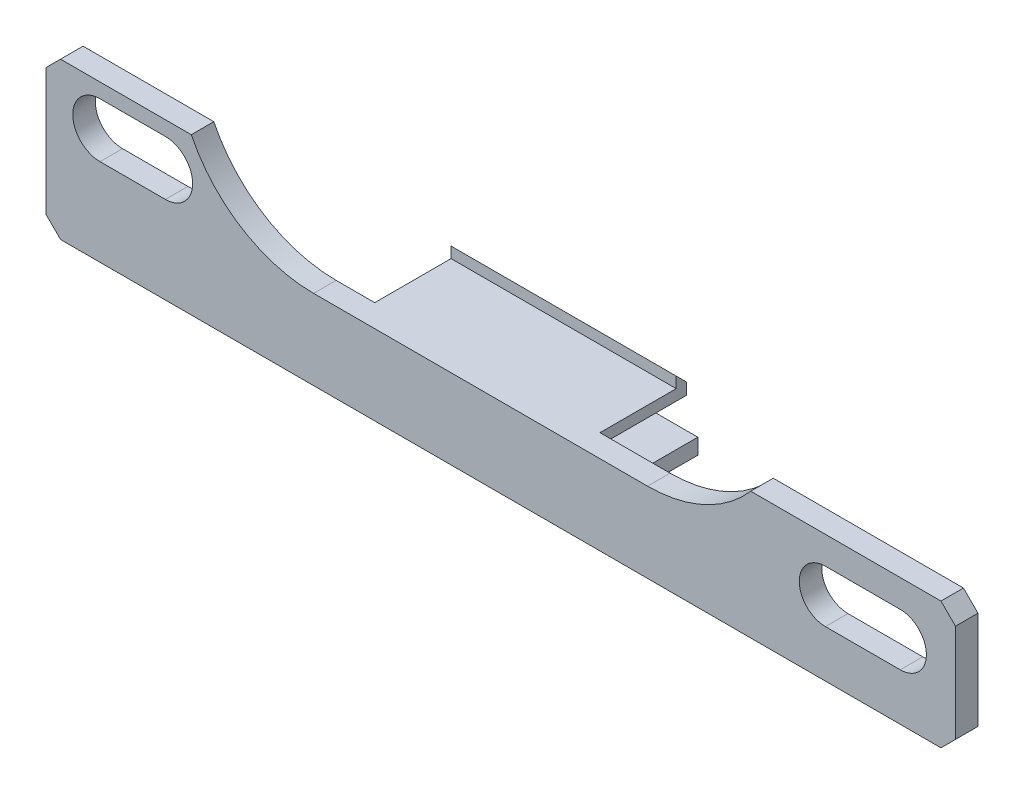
ISO-10303-21;
HEADER;
FILE_DESCRIPTION(('STEP AP214'),'2;1');
FILE_NAME('part.step','',(''),(''),'','','');
FILE_SCHEMA(('AUTOMOTIVE_DESIGN { 1 0 10303 214 1 1 1 1 }'));
ENDSEC;
DATA;
#1=APPLICATION_CONTEXT('core data for automotive mechanical design processes');
#2=APPLICATION_PROTOCOL_DEFINITION('international standard','automotive_design',2000,#1);
#3=PRODUCT_CONTEXT('',#1,'mechanical');
#4=PRODUCT('Part','Part','',(#3));
#5=PRODUCT_RELATED_PRODUCT_CATEGORY('part','',(#4));
#6=PRODUCT_DEFINITION_FORMATION('','',#4);
#7=PRODUCT_DEFINITION_CONTEXT('part definition',#1,'design');
#8=PRODUCT_DEFINITION('design','',#6,#7);
#9=PRODUCT_DEFINITION_SHAPE('','',#8);
#10=(LENGTH_UNIT() NAMED_UNIT(*) SI_UNIT(.MILLI.,.METRE.));
#11=(NAMED_UNIT(*) PLANE_ANGLE_UNIT() SI_UNIT($,.RADIAN.));
#12=(NAMED_UNIT(*) SI_UNIT($,.STERADIAN.) SOLID_ANGLE_UNIT());
#13=UNCERTAINTY_MEASURE_WITH_UNIT(LENGTH_MEASURE(1.E-05),#10,'distance_accuracy_value','');
#14=(GEOMETRIC_REPRESENTATION_CONTEXT(3) GLOBAL_UNCERTAINTY_ASSIGNED_CONTEXT((#13)) GLOBAL_UNIT_ASSIGNED_CONTEXT((#10,
#11,#12)) REPRESENTATION_CONTEXT('',''));
#15=CARTESIAN_POINT('',(0.,0.,0.));
#16=DIRECTION('',(0.,0.,1.));
#17=DIRECTION('',(1.,0.,0.));
#18=AXIS2_PLACEMENT_3D('',#15,#16,#17);
#19=CARTESIAN_POINT('',(42.0649046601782,15.113,-1.5748));
#20=DIRECTION('',(0.,0.,-1.));
#21=DIRECTION('',(-1.,0.,0.));
#22=AXIS2_PLACEMENT_3D('',#19,#20,#21);
#23=PLANE('',#22);
#24=DIRECTION('',(0.,1.,0.));
#25=VECTOR('',#24,1.);
#26=CARTESIAN_POINT('',(20.687107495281,15.113,-1.5748));
#27=LINE('',#26,#25);
#28=CARTESIAN_POINT('',(20.687107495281,1.6002,-1.5748));
#29=VERTEX_POINT('',#28);
#30=CARTESIAN_POINT('',(20.687107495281,2.6924,-1.5748));
#31=VERTEX_POINT('',#30);
#32=EDGE_CURVE('E327',#29,#31,#27,.T.);
#33=ORIENTED_EDGE('',*,*,#32,.F.);
#34=DIRECTION('',(-1.,0.,0.));
#35=VECTOR('',#34,1.);
#36=CARTESIAN_POINT('',(42.0649046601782,1.6002,-1.5748));
#37=LINE('',#36,#35);
#38=CARTESIAN_POINT('',(37.959107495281,1.6002,-1.5748));
#39=VERTEX_POINT('',#38);
#40=EDGE_CURVE('E310',#39,#29,#37,.T.);
#41=ORIENTED_EDGE('',*,*,#40,.F.);
#42=DIRECTION('',(0.,-1.,0.));
#43=VECTOR('',#42,1.);
#44=CARTESIAN_POINT('',(37.959107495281,15.113,-1.5748));
#45=LINE('',#44,#43);
#46=CARTESIAN_POINT('',(37.959107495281,2.6924,-1.5748));
#47=VERTEX_POINT('',#46);
#48=EDGE_CURVE('E321',#47,#39,#45,.T.);
#49=ORIENTED_EDGE('',*,*,#48,.F.);
#50=DIRECTION('',(1.,0.,0.));
#51=VECTOR('',#50,1.);
#52=CARTESIAN_POINT('',(42.0649046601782,2.6924,-1.5748));
#53=LINE('',#52,#51);
#54=EDGE_CURVE('E324',#31,#47,#53,.T.);
#55=ORIENTED_EDGE('',*,*,#54,.F.);
#56=EDGE_LOOP('',(#33,#41,#49,#55));
#57=FACE_BOUND('',#56,.T.);
#58=CARTESIAN_POINT('',(54.4998284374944,5.1308,-1.5748));
#59=DIRECTION('',(0.,0.,1.));
#60=DIRECTION('',(1.,0.,0.));
#61=AXIS2_PLACEMENT_3D('',#58,#59,#60);
#62=CIRCLE('',#61,1.8288);
#63=CARTESIAN_POINT('',(54.4998284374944,6.9596,-1.5748));
#64=VERTEX_POINT('',#63);
#65=CARTESIAN_POINT('',(54.4998284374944,3.302,-1.5748));
#66=VERTEX_POINT('',#65);
#67=EDGE_CURVE('E331',#64,#66,#62,.T.);
#68=ORIENTED_EDGE('',*,*,#67,.T.);
#69=DIRECTION('',(1.,0.,0.));
#70=VECTOR('',#69,1.);
#71=CARTESIAN_POINT('',(54.4998284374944,3.302,-1.5748));
#72=LINE('',#71,#70);
#73=CARTESIAN_POINT('',(59.7322284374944,3.302,-1.5748));
#74=VERTEX_POINT('',#73);
#75=EDGE_CURVE('E334',#66,#74,#72,.T.);
#76=ORIENTED_EDGE('',*,*,#75,.T.);
#77=CARTESIAN_POINT('',(59.7322284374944,5.1308,-1.5748));
#78=DIRECTION('',(0.,0.,1.));
#79=DIRECTION('',(1.,0.,0.));
#80=AXIS2_PLACEMENT_3D('',#77,#78,#79);
#81=CIRCLE('',#80,1.8288);
#82=CARTESIAN_POINT('',(59.7322284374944,6.9596,-1.5748));
#83=VERTEX_POINT('',#82);
#84=EDGE_CURVE('E338',#74,#83,#81,.T.);
#85=ORIENTED_EDGE('',*,*,#84,.T.);
#86=DIRECTION('',(-1.,0.,0.));
#87=VECTOR('',#86,1.);
#88=CARTESIAN_POINT('',(54.4998284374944,6.9596,-1.5748));
#89=LINE('',#88,#87);
#90=EDGE_CURVE('E341',#83,#64,#89,.T.);
#91=ORIENTED_EDGE('',*,*,#90,.T.);
#92=EDGE_LOOP('',(#68,#76,#85,#91));
#93=FACE_BOUND('',#92,.T.);
#94=CARTESIAN_POINT('',(3.7760284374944,8.001,-1.5748));
#95=DIRECTION('',(0.,0.,1.));
#96=DIRECTION('',(1.,0.,0.));
#97=AXIS2_PLACEMENT_3D('',#94,#95,#96);
#98=CIRCLE('',#97,1.905);
#99=CARTESIAN_POINT('',(3.7760284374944,9.906,-1.5748));
#100=VERTEX_POINT('',#99);
#101=CARTESIAN_POINT('',(3.7760284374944,6.096,-1.5748));
#102=VERTEX_POINT('',#101);
#103=EDGE_CURVE('E363',#100,#102,#98,.T.);
#104=ORIENTED_EDGE('',*,*,#103,.T.);
#105=DIRECTION('',(1.,0.,0.));
#106=VECTOR('',#105,1.);
#107=CARTESIAN_POINT('',(3.7760284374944,6.096,-1.5748));
#108=LINE('',#107,#106);
#109=CARTESIAN_POINT('',(8.3480284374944,6.096,-1.5748));
#110=VERTEX_POINT('',#109);
#111=EDGE_CURVE('E366',#102,#110,#108,.T.);
#112=ORIENTED_EDGE('',*,*,#111,.T.);
#113=CARTESIAN_POINT('',(8.3480284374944,8.001,-1.5748));
#114=DIRECTION('',(0.,0.,1.));
#115=DIRECTION('',(1.,0.,0.));
#116=AXIS2_PLACEMENT_3D('',#113,#114,#115);
#117=CIRCLE('',#116,1.905);
#118=CARTESIAN_POINT('',(8.3480284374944,9.906,-1.5748));
#119=VERTEX_POINT('',#118);
#120=EDGE_CURVE('E370',#110,#119,#117,.T.);
#121=ORIENTED_EDGE('',*,*,#120,.T.);
#122=DIRECTION('',(-1.,0.,0.));
#123=VECTOR('',#122,1.);
#124=CARTESIAN_POINT('',(3.7760284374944,9.906,-1.5748));
#125=LINE('',#124,#123);
#126=EDGE_CURVE('E373',#119,#100,#125,.T.);
#127=ORIENTED_EDGE('',*,*,#126,.T.);
#128=EDGE_LOOP('',(#104,#112,#121,#127));
#129=FACE_BOUND('',#128,.T.);
#130=DIRECTION('',(0.,1.,0.));
#131=VECTOR('',#130,1.);
#132=CARTESIAN_POINT('',(63.595327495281,0.,-1.5748));
#133=LINE('',#132,#131);
#134=CARTESIAN_POINT('',(63.595327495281,1.016,-1.5748));
#135=VERTEX_POINT('',#134);
#136=CARTESIAN_POINT('',(63.595327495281,7.87399999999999,-1.5748));
#137=VERTEX_POINT('',#136);
#138=EDGE_CURVE('E398',#135,#137,#133,.T.);
#139=ORIENTED_EDGE('',*,*,#138,.F.);
#140=DIRECTION('',(0.707106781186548,0.707106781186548,0.));
#141=VECTOR('',#140,1.);
#142=CARTESIAN_POINT('',(59.8786160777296,-2.70071141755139,-1.5748));
#143=LINE('',#142,#141);
#144=CARTESIAN_POINT('',(62.579327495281,0.,-1.5748));
#145=VERTEX_POINT('',#144);
#146=EDGE_CURVE('E468',#135,#145,#143,.F.);
#147=ORIENTED_EDGE('',*,*,#146,.T.);
#148=DIRECTION('',(1.,0.,0.));
#149=VECTOR('',#148,1.);
#150=CARTESIAN_POINT('',(0.,0.,-1.5748));
#151=LINE('',#150,#149);
#152=CARTESIAN_POINT('',(1.01600000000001,0.,-1.5748));
#153=VERTEX_POINT('',#152);
#154=EDGE_CURVE('E395',#153,#145,#151,.T.);
#155=ORIENTED_EDGE('',*,*,#154,.F.);
#156=DIRECTION('',(0.707106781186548,-0.707106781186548,0.));
#157=VECTOR('',#156,1.);
#158=CARTESIAN_POINT('',(13.9839523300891,-12.9679523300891,-1.5748));
#159=LINE('',#158,#157);
#160=CARTESIAN_POINT('',(0.,1.01600000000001,-1.5748));
#161=VERTEX_POINT('',#160);
#162=EDGE_CURVE('E55',#153,#161,#159,.F.);
#163=ORIENTED_EDGE('',*,*,#162,.T.);
#164=DIRECTION('',(0.,-1.,0.));
#165=VECTOR('',#164,1.);
#166=CARTESIAN_POINT('',(0.,0.,-1.5748));
#167=LINE('',#166,#165);
#168=CARTESIAN_POINT('',(0.,9.90599999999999,-1.5748));
#169=VERTEX_POINT('',#168);
#170=EDGE_CURVE('E414',#169,#161,#167,.T.);
#171=ORIENTED_EDGE('',*,*,#170,.F.);
#172=DIRECTION('',(-0.707106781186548,-0.707106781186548,0.));
#173=VECTOR('',#172,1.);
#174=CARTESIAN_POINT('',(23.6359523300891,33.5419523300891,-1.5748));
#175=LINE('',#174,#173);
#176=CARTESIAN_POINT('',(1.01600000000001,10.922,-1.5748));
#177=VERTEX_POINT('',#176);
#178=EDGE_CURVE('E49',#169,#177,#175,.F.);
#179=ORIENTED_EDGE('',*,*,#178,.T.);
#180=DIRECTION('',(-1.,0.,0.));
#181=VECTOR('',#180,1.);
#182=CARTESIAN_POINT('',(0.,10.922,-1.5748));
#183=LINE('',#182,#181);
#184=CARTESIAN_POINT('',(10.16,10.922,-1.5748));
#185=VERTEX_POINT('',#184);
#186=EDGE_CURVE('E412',#185,#177,#183,.T.);
#187=ORIENTED_EDGE('',*,*,#186,.F.);
#188=CARTESIAN_POINT('',(18.7134287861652,15.113,-1.5748));
#189=DIRECTION('',(0.,0.,-1.));
#190=DIRECTION('',(1.,0.,0.));
#191=AXIS2_PLACEMENT_3D('',#188,#189,#190);
#192=CIRCLE('',#191,9.525);
#193=CARTESIAN_POINT('',(18.7134287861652,5.588,-1.5748));
#194=VERTEX_POINT('',#193);
#195=EDGE_CURVE('E409',#194,#185,#192,.T.);
#196=ORIENTED_EDGE('',*,*,#195,.F.);
#197=DIRECTION('',(-1.,0.,0.));
#198=VECTOR('',#197,1.);
#199=CARTESIAN_POINT('',(18.7134287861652,5.588,-1.5748));
#200=LINE('',#199,#198);
#201=CARTESIAN_POINT('',(21.4122,5.588,-1.5748));
#202=VERTEX_POINT('',#201);
#203=EDGE_CURVE('E407',#202,#194,#200,.T.);
#204=ORIENTED_EDGE('',*,*,#203,.F.);
#205=DIRECTION('',(0.,1.,0.));
#206=VECTOR('',#205,1.);
#207=CARTESIAN_POINT('',(21.4122,4.826,-1.5748));
#208=LINE('',#207,#206);
#209=CARTESIAN_POINT('',(21.4122,4.826,-1.5748));
#210=VERTEX_POINT('',#209);
#211=EDGE_CURVE('E272',#210,#202,#208,.T.);
#212=ORIENTED_EDGE('',*,*,#211,.F.);
#213=DIRECTION('',(-1.,0.,0.));
#214=VECTOR('',#213,1.);
#215=CARTESIAN_POINT('',(37.1602,4.826,-1.5748));
#216=LINE('',#215,#214);
#217=CARTESIAN_POINT('',(37.1602,4.826,-1.5748));
#218=VERTEX_POINT('',#217);
#219=EDGE_CURVE('E286',#218,#210,#216,.T.);
#220=ORIENTED_EDGE('',*,*,#219,.F.);
#221=DIRECTION('',(0.,1.,0.));
#222=VECTOR('',#221,1.);
#223=CARTESIAN_POINT('',(37.1602,4.826,-1.5748));
#224=LINE('',#223,#222);
#225=CARTESIAN_POINT('',(37.1602,5.588,-1.5748));
#226=VERTEX_POINT('',#225);
#227=EDGE_CURVE('E261',#218,#226,#224,.T.);
#228=ORIENTED_EDGE('',*,*,#227,.T.);
#229=CARTESIAN_POINT('',(42.0649046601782,5.588,-1.5748));
#230=VERTEX_POINT('',#229);
#231=EDGE_CURVE('E260',#230,#226,#200,.T.);
#232=ORIENTED_EDGE('',*,*,#231,.F.);
#233=CARTESIAN_POINT('',(42.0649046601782,15.113,-1.5748));
#234=DIRECTION('',(0.,0.,-1.));
#235=DIRECTION('',(-1.,0.,0.));
#236=AXIS2_PLACEMENT_3D('',#233,#234,#235);
#237=CIRCLE('',#236,9.525);
#238=CARTESIAN_POINT('',(49.276,8.89,-1.5748));
#239=VERTEX_POINT('',#238);
#240=EDGE_CURVE('E404',#239,#230,#237,.T.);
#241=ORIENTED_EDGE('',*,*,#240,.F.);
#242=DIRECTION('',(-1.,0.,0.));
#243=VECTOR('',#242,1.);
#244=CARTESIAN_POINT('',(63.595327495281,8.89,-1.5748));
#245=LINE('',#244,#243);
#246=CARTESIAN_POINT('',(62.5793274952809,8.89,-1.5748));
#247=VERTEX_POINT('',#246);
#248=EDGE_CURVE('E402',#247,#239,#245,.T.);
#249=ORIENTED_EDGE('',*,*,#248,.F.);
#250=DIRECTION('',(-0.70710678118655,0.707106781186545,0.));
#251=VECTOR('',#250,1.);
#252=CARTESIAN_POINT('',(49.2106160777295,22.2587114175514,-1.5748));
#253=LINE('',#252,#251);
#254=EDGE_CURVE('E466',#247,#137,#253,.F.);
#255=ORIENTED_EDGE('',*,*,#254,.T.);
#256=EDGE_LOOP('',(#139,#147,#155,#163,#171,#179,#187,#196,#204,#212,#220,#228,#232,#241,#249,#255));
#257=FACE_BOUND('',#256,.T.);
#258=ADVANCED_FACE('F34',(#57,#93,#129,#257),#23,.T.);
#259=CARTESIAN_POINT('',(0.,0.,-1.5748));
#260=DIRECTION('',(0.,-1.,0.));
#261=DIRECTION('',(0.,0.,-1.));
#262=AXIS2_PLACEMENT_3D('',#259,#260,#261);
#263=PLANE('',#262);
#264=ORIENTED_EDGE('',*,*,#154,.T.);
#265=DIRECTION('',(0.,0.,1.));
#266=VECTOR('',#265,1.);
#267=CARTESIAN_POINT('',(62.579327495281,0.,-1.5748));
#268=LINE('',#267,#266);
#269=CARTESIAN_POINT('',(62.579327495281,0.,0.));
#270=VERTEX_POINT('',#269);
#271=EDGE_CURVE('E448',#145,#270,#268,.T.);
#272=ORIENTED_EDGE('',*,*,#271,.T.);
#273=DIRECTION('',(1.,0.,0.));
#274=VECTOR('',#273,1.);
#275=CARTESIAN_POINT('',(0.,0.,0.));
#276=LINE('',#275,#274);
#277=CARTESIAN_POINT('',(1.01600000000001,0.,0.));
#278=VERTEX_POINT('',#277);
#279=EDGE_CURVE('E388',#278,#270,#276,.T.);
#280=ORIENTED_EDGE('',*,*,#279,.F.);
#281=DIRECTION('',(0.,0.,-1.));
#282=VECTOR('',#281,1.);
#283=CARTESIAN_POINT('',(1.01600000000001,0.,-1.5748));
#284=LINE('',#283,#282);
#285=EDGE_CURVE('E440',#278,#153,#284,.T.);
#286=ORIENTED_EDGE('',*,*,#285,.T.);
#287=EDGE_LOOP('',(#264,#272,#280,#286));
#288=FACE_BOUND('',#287,.T.);
#289=ADVANCED_FACE('F527',(#288),#263,.T.);
#290=CARTESIAN_POINT('',(0.,0.,-1.5748));
#291=DIRECTION('',(-1.,0.,0.));
#292=DIRECTION('',(0.,0.,1.));
#293=AXIS2_PLACEMENT_3D('',#290,#291,#292);
#294=PLANE('',#293);
#295=ORIENTED_EDGE('',*,*,#170,.T.);
#296=DIRECTION('',(0.,0.,1.));
#297=VECTOR('',#296,1.);
#298=CARTESIAN_POINT('',(0.,1.01600000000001,-1.5748));
#299=LINE('',#298,#297);
#300=CARTESIAN_POINT('',(0.,1.01600000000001,0.));
#301=VERTEX_POINT('',#300);
#302=EDGE_CURVE('E42',#161,#301,#299,.T.);
#303=ORIENTED_EDGE('',*,*,#302,.T.);
#304=DIRECTION('',(0.,-1.,0.));
#305=VECTOR('',#304,1.);
#306=CARTESIAN_POINT('',(0.,0.,0.));
#307=LINE('',#306,#305);
#308=CARTESIAN_POINT('',(0.,9.90599999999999,0.));
#309=VERTEX_POINT('',#308);
#310=EDGE_CURVE('E399',#309,#301,#307,.T.);
#311=ORIENTED_EDGE('',*,*,#310,.F.);
#312=DIRECTION('',(0.,0.,-1.));
#313=VECTOR('',#312,1.);
#314=CARTESIAN_POINT('',(0.,9.90599999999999,-1.5748));
#315=LINE('',#314,#313);
#316=EDGE_CURVE('E472',#309,#169,#315,.T.);
#317=ORIENTED_EDGE('',*,*,#316,.T.);
#318=EDGE_LOOP('',(#295,#303,#311,#317));
#319=FACE_BOUND('',#318,.T.);
#320=ADVANCED_FACE('F477',(#319),#294,.T.);
#321=CARTESIAN_POINT('',(0.,10.922,-1.5748));
#322=DIRECTION('',(0.,1.,0.));
#323=DIRECTION('',(0.,0.,1.));
#324=AXIS2_PLACEMENT_3D('',#321,#322,#323);
#325=PLANE('',#324);
#326=ORIENTED_EDGE('',*,*,#186,.T.);
#327=DIRECTION('',(0.,0.,1.));
#328=VECTOR('',#327,1.);
#329=CARTESIAN_POINT('',(1.01600000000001,10.922,-1.5748));
#330=LINE('',#329,#328);
#331=CARTESIAN_POINT('',(1.01600000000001,10.922,0.));
#332=VERTEX_POINT('',#331);
#333=EDGE_CURVE('E11',#177,#332,#330,.T.);
#334=ORIENTED_EDGE('',*,*,#333,.T.);
#335=DIRECTION('',(-1.,0.,0.));
#336=VECTOR('',#335,1.);
#337=CARTESIAN_POINT('',(0.,10.922,0.));
#338=LINE('',#337,#336);
#339=CARTESIAN_POINT('',(10.16,10.922,0.));
#340=VERTEX_POINT('',#339);
#341=EDGE_CURVE('E433',#340,#332,#338,.T.);
#342=ORIENTED_EDGE('',*,*,#341,.F.);
#343=DIRECTION('',(0.,0.,1.));
#344=VECTOR('',#343,1.);
#345=CARTESIAN_POINT('',(10.16,10.922,-1.5748));
#346=LINE('',#345,#344);
#347=EDGE_CURVE('E438',#185,#340,#346,.T.);
#348=ORIENTED_EDGE('',*,*,#347,.F.);
#349=EDGE_LOOP('',(#326,#334,#342,#348));
#350=FACE_BOUND('',#349,.T.);
#351=ADVANCED_FACE('F487',(#350),#325,.T.);
#352=CARTESIAN_POINT('',(18.7134287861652,15.113,-1.5748));
#353=DIRECTION('',(0.,0.,1.));
#354=DIRECTION('',(1.,0.,0.));
#355=AXIS2_PLACEMENT_3D('',#352,#353,#354);
#356=CYLINDRICAL_SURFACE('',#355,9.525);
#357=CARTESIAN_POINT('',(18.7134287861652,15.113,0.));
#358=DIRECTION('',(0.,0.,-1.));
#359=DIRECTION('',(1.,0.,0.));
#360=AXIS2_PLACEMENT_3D('',#357,#358,#359);
#361=CIRCLE('',#360,9.525);
#362=CARTESIAN_POINT('',(18.7134287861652,5.588,0.));
#363=VERTEX_POINT('',#362);
#364=EDGE_CURVE('E430',#363,#340,#361,.T.);
#365=ORIENTED_EDGE('',*,*,#364,.F.);
#366=DIRECTION('',(0.,0.,1.));
#367=VECTOR('',#366,1.);
#368=CARTESIAN_POINT('',(18.7134287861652,5.588,-1.5748));
#369=LINE('',#368,#367);
#370=EDGE_CURVE('E441',#194,#363,#369,.T.);
#371=ORIENTED_EDGE('',*,*,#370,.F.);
#372=ORIENTED_EDGE('',*,*,#195,.T.);
#373=ORIENTED_EDGE('',*,*,#347,.T.);
#374=EDGE_LOOP('',(#365,#371,#372,#373));
#375=FACE_BOUND('',#374,.T.);
#376=ADVANCED_FACE('F493',(#375),#356,.F.);
#377=CARTESIAN_POINT('',(18.7134287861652,5.588,-1.5748));
#378=DIRECTION('',(0.,1.,0.));
#379=DIRECTION('',(0.,0.,1.));
#380=AXIS2_PLACEMENT_3D('',#377,#378,#379);
#381=PLANE('',#380);
#382=DIRECTION('',(-1.,0.,0.));
#383=VECTOR('',#382,1.);
#384=CARTESIAN_POINT('',(18.7134287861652,5.588,0.));
#385=LINE('',#384,#383);
#386=CARTESIAN_POINT('',(42.0649046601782,5.588,0.));
#387=VERTEX_POINT('',#386);
#388=EDGE_CURVE('E427',#387,#363,#385,.T.);
#389=ORIENTED_EDGE('',*,*,#388,.F.);
#390=DIRECTION('',(0.,0.,1.));
#391=VECTOR('',#390,1.);
#392=CARTESIAN_POINT('',(42.0649046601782,5.588,-1.5748));
#393=LINE('',#392,#391);
#394=EDGE_CURVE('E443',#230,#387,#393,.T.);
#395=ORIENTED_EDGE('',*,*,#394,.F.);
#396=ORIENTED_EDGE('',*,*,#231,.T.);
#397=DIRECTION('',(0.,0.,-1.));
#398=VECTOR('',#397,1.);
#399=CARTESIAN_POINT('',(37.1602,5.588,-1.5748));
#400=LINE('',#399,#398);
#401=CARTESIAN_POINT('',(37.1602,5.588,-6.9088));
#402=VERTEX_POINT('',#401);
#403=EDGE_CURVE('E251',#226,#402,#400,.T.);
#404=ORIENTED_EDGE('',*,*,#403,.T.);
#405=DIRECTION('',(-1.,0.,0.));
#406=VECTOR('',#405,1.);
#407=CARTESIAN_POINT('',(37.1602,5.588,-6.9088));
#408=LINE('',#407,#406);
#409=CARTESIAN_POINT('',(21.4122,5.588,-6.9088));
#410=VERTEX_POINT('',#409);
#411=EDGE_CURVE('E233',#402,#410,#408,.T.);
#412=ORIENTED_EDGE('',*,*,#411,.T.);
#413=DIRECTION('',(0.,0.,-1.));
#414=VECTOR('',#413,1.);
#415=CARTESIAN_POINT('',(21.4122,5.588,-1.5748));
#416=LINE('',#415,#414);
#417=EDGE_CURVE('E275',#202,#410,#416,.T.);
#418=ORIENTED_EDGE('',*,*,#417,.F.);
#419=ORIENTED_EDGE('',*,*,#203,.T.);
#420=ORIENTED_EDGE('',*,*,#370,.T.);
#421=EDGE_LOOP('',(#389,#395,#396,#404,#412,#418,#419,#420));
#422=FACE_BOUND('',#421,.T.);
#423=ADVANCED_FACE('F258',(#422),#381,.T.);
#424=CARTESIAN_POINT('',(42.0649046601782,15.113,-1.5748));
#425=DIRECTION('',(0.,0.,1.));
#426=DIRECTION('',(1.,0.,0.));
#427=AXIS2_PLACEMENT_3D('',#424,#425,#426);
#428=CYLINDRICAL_SURFACE('',#427,9.525);
#429=CARTESIAN_POINT('',(42.0649046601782,15.113,0.));
#430=DIRECTION('',(0.,0.,-1.));
#431=DIRECTION('',(-1.,0.,0.));
#432=AXIS2_PLACEMENT_3D('',#429,#430,#431);
#433=CIRCLE('',#432,9.525);
#434=CARTESIAN_POINT('',(49.276,8.89,0.));
#435=VERTEX_POINT('',#434);
#436=EDGE_CURVE('E424',#435,#387,#433,.T.);
#437=ORIENTED_EDGE('',*,*,#436,.F.);
#438=DIRECTION('',(0.,0.,1.));
#439=VECTOR('',#438,1.);
#440=CARTESIAN_POINT('',(49.276,8.89,-1.5748));
#441=LINE('',#440,#439);
#442=EDGE_CURVE('E416',#239,#435,#441,.T.);
#443=ORIENTED_EDGE('',*,*,#442,.F.);
#444=ORIENTED_EDGE('',*,*,#240,.T.);
#445=ORIENTED_EDGE('',*,*,#394,.T.);
#446=EDGE_LOOP('',(#437,#443,#444,#445));
#447=FACE_BOUND('',#446,.T.);
#448=ADVANCED_FACE('F509',(#447),#428,.F.);
#449=CARTESIAN_POINT('',(63.595327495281,8.89,-1.5748));
#450=DIRECTION('',(0.,1.,0.));
#451=DIRECTION('',(-1.,0.,0.));
#452=AXIS2_PLACEMENT_3D('',#449,#450,#451);
#453=PLANE('',#452);
#454=DIRECTION('',(-1.,0.,0.));
#455=VECTOR('',#454,1.);
#456=CARTESIAN_POINT('',(63.595327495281,8.89,0.));
#457=LINE('',#456,#455);
#458=CARTESIAN_POINT('',(62.5793274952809,8.89,0.));
#459=VERTEX_POINT('',#458);
#460=EDGE_CURVE('E422',#459,#435,#457,.T.);
#461=ORIENTED_EDGE('',*,*,#460,.F.);
#462=DIRECTION('',(0.,0.,-1.));
#463=VECTOR('',#462,1.);
#464=CARTESIAN_POINT('',(62.5793274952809,8.89,-1.5748));
#465=LINE('',#464,#463);
#466=EDGE_CURVE('E470',#459,#247,#465,.T.);
#467=ORIENTED_EDGE('',*,*,#466,.T.);
#468=ORIENTED_EDGE('',*,*,#248,.T.);
#469=ORIENTED_EDGE('',*,*,#442,.T.);
#470=EDGE_LOOP('',(#461,#467,#468,#469));
#471=FACE_BOUND('',#470,.T.);
#472=ADVANCED_FACE('F512',(#471),#453,.T.);
#473=CARTESIAN_POINT('',(63.595327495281,0.,-1.5748));
#474=DIRECTION('',(1.,0.,0.));
#475=DIRECTION('',(0.,0.,-1.));
#476=AXIS2_PLACEMENT_3D('',#473,#474,#475);
#477=PLANE('',#476);
#478=DIRECTION('',(0.,1.,0.));
#479=VECTOR('',#478,1.);
#480=CARTESIAN_POINT('',(63.595327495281,0.,0.));
#481=LINE('',#480,#479);
#482=CARTESIAN_POINT('',(63.595327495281,1.016,0.));
#483=VERTEX_POINT('',#482);
#484=CARTESIAN_POINT('',(63.595327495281,7.87399999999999,0.));
#485=VERTEX_POINT('',#484);
#486=EDGE_CURVE('E419',#483,#485,#481,.T.);
#487=ORIENTED_EDGE('',*,*,#486,.F.);
#488=DIRECTION('',(0.,0.,-1.));
#489=VECTOR('',#488,1.);
#490=CARTESIAN_POINT('',(63.595327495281,1.016,-1.5748));
#491=LINE('',#490,#489);
#492=EDGE_CURVE('E462',#483,#135,#491,.T.);
#493=ORIENTED_EDGE('',*,*,#492,.T.);
#494=ORIENTED_EDGE('',*,*,#138,.T.);
#495=DIRECTION('',(0.,0.,1.));
#496=VECTOR('',#495,1.);
#497=CARTESIAN_POINT('',(63.595327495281,7.87399999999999,-1.5748));
#498=LINE('',#497,#496);
#499=EDGE_CURVE('E459',#137,#485,#498,.T.);
#500=ORIENTED_EDGE('',*,*,#499,.T.);
#501=EDGE_LOOP('',(#487,#493,#494,#500));
#502=FACE_BOUND('',#501,.T.);
#503=ADVANCED_FACE('F520',(#502),#477,.T.);
#504=CARTESIAN_POINT('',(42.0649046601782,15.113,0.));
#505=DIRECTION('',(0.,0.,-1.));
#506=DIRECTION('',(-1.,0.,0.));
#507=AXIS2_PLACEMENT_3D('',#504,#505,#506);
#508=PLANE('',#507);
#509=DIRECTION('',(1.,0.,0.));
#510=VECTOR('',#509,1.);
#511=CARTESIAN_POINT('',(54.4998284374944,3.302,0.));
#512=LINE('',#511,#510);
#513=CARTESIAN_POINT('',(54.4998284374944,3.302,0.));
#514=VERTEX_POINT('',#513);
#515=CARTESIAN_POINT('',(59.7322284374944,3.302,0.));
#516=VERTEX_POINT('',#515);
#517=EDGE_CURVE('E346',#514,#516,#512,.T.);
#518=ORIENTED_EDGE('',*,*,#517,.F.);
#519=CARTESIAN_POINT('',(54.4998284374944,5.1308,0.));
#520=DIRECTION('',(0.,0.,1.));
#521=DIRECTION('',(1.,0.,0.));
#522=AXIS2_PLACEMENT_3D('',#519,#520,#521);
#523=CIRCLE('',#522,1.8288);
#524=CARTESIAN_POINT('',(54.4998284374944,6.9596,0.));
#525=VERTEX_POINT('',#524);
#526=EDGE_CURVE('E330',#525,#514,#523,.T.);
#527=ORIENTED_EDGE('',*,*,#526,.F.);
#528=DIRECTION('',(-1.,0.,0.));
#529=VECTOR('',#528,1.);
#530=CARTESIAN_POINT('',(54.4998284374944,6.9596,0.));
#531=LINE('',#530,#529);
#532=CARTESIAN_POINT('',(59.7322284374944,6.9596,0.));
#533=VERTEX_POINT('',#532);
#534=EDGE_CURVE('E335',#533,#525,#531,.T.);
#535=ORIENTED_EDGE('',*,*,#534,.F.);
#536=CARTESIAN_POINT('',(59.7322284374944,5.1308,0.));
#537=DIRECTION('',(0.,0.,1.));
#538=DIRECTION('',(1.,0.,0.));
#539=AXIS2_PLACEMENT_3D('',#536,#537,#538);
#540=CIRCLE('',#539,1.8288);
#541=EDGE_CURVE('E349',#516,#533,#540,.T.);
#542=ORIENTED_EDGE('',*,*,#541,.F.);
#543=EDGE_LOOP('',(#518,#527,#535,#542));
#544=FACE_BOUND('',#543,.T.);
#545=DIRECTION('',(1.,0.,0.));
#546=VECTOR('',#545,1.);
#547=CARTESIAN_POINT('',(3.7760284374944,6.096,0.));
#548=LINE('',#547,#546);
#549=CARTESIAN_POINT('',(3.7760284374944,6.096,0.));
#550=VERTEX_POINT('',#549);
#551=CARTESIAN_POINT('',(8.3480284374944,6.096,0.));
#552=VERTEX_POINT('',#551);
#553=EDGE_CURVE('E378',#550,#552,#548,.T.);
#554=ORIENTED_EDGE('',*,*,#553,.F.);
#555=CARTESIAN_POINT('',(3.7760284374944,8.001,0.));
#556=DIRECTION('',(0.,0.,1.));
#557=DIRECTION('',(1.,0.,0.));
#558=AXIS2_PLACEMENT_3D('',#555,#556,#557);
#559=CIRCLE('',#558,1.905);
#560=CARTESIAN_POINT('',(3.7760284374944,9.906,0.));
#561=VERTEX_POINT('',#560);
#562=EDGE_CURVE('E356',#561,#550,#559,.T.);
#563=ORIENTED_EDGE('',*,*,#562,.F.);
#564=DIRECTION('',(-1.,0.,0.));
#565=VECTOR('',#564,1.);
#566=CARTESIAN_POINT('',(3.7760284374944,9.906,0.));
#567=LINE('',#566,#565);
#568=CARTESIAN_POINT('',(8.3480284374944,9.906,0.));
#569=VERTEX_POINT('',#568);
#570=EDGE_CURVE('E367',#569,#561,#567,.T.);
#571=ORIENTED_EDGE('',*,*,#570,.F.);
#572=CARTESIAN_POINT('',(8.3480284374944,8.001,0.));
#573=DIRECTION('',(0.,0.,1.));
#574=DIRECTION('',(1.,0.,0.));
#575=AXIS2_PLACEMENT_3D('',#572,#573,#574);
#576=CIRCLE('',#575,1.905);
#577=EDGE_CURVE('E381',#552,#569,#576,.T.);
#578=ORIENTED_EDGE('',*,*,#577,.F.);
#579=EDGE_LOOP('',(#554,#563,#571,#578));
#580=FACE_BOUND('',#579,.T.);
#581=ORIENTED_EDGE('',*,*,#279,.T.);
#582=DIRECTION('',(-0.707106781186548,-0.707106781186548,0.));
#583=VECTOR('',#582,1.);
#584=CARTESIAN_POINT('',(62.579327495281,0.,0.));
#585=LINE('',#584,#583);
#586=EDGE_CURVE('E457',#270,#483,#585,.F.);
#587=ORIENTED_EDGE('',*,*,#586,.T.);
#588=ORIENTED_EDGE('',*,*,#486,.T.);
#589=DIRECTION('',(0.70710678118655,-0.707106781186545,0.));
#590=VECTOR('',#589,1.);
#591=CARTESIAN_POINT('',(63.595327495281,7.87399999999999,0.));
#592=LINE('',#591,#590);
#593=EDGE_CURVE('E455',#485,#459,#592,.F.);
#594=ORIENTED_EDGE('',*,*,#593,.T.);
#595=ORIENTED_EDGE('',*,*,#460,.T.);
#596=ORIENTED_EDGE('',*,*,#436,.T.);
#597=ORIENTED_EDGE('',*,*,#388,.T.);
#598=ORIENTED_EDGE('',*,*,#364,.T.);
#599=ORIENTED_EDGE('',*,*,#341,.T.);
#600=DIRECTION('',(0.707106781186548,0.707106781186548,0.));
#601=VECTOR('',#600,1.);
#602=CARTESIAN_POINT('',(1.01600000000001,10.922,0.));
#603=LINE('',#602,#601);
#604=EDGE_CURVE('E451',#332,#309,#603,.F.);
#605=ORIENTED_EDGE('',*,*,#604,.T.);
#606=ORIENTED_EDGE('',*,*,#310,.T.);
#607=DIRECTION('',(-0.707106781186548,0.707106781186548,0.));
#608=VECTOR('',#607,1.);
#609=CARTESIAN_POINT('',(0.,1.01600000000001,0.));
#610=LINE('',#609,#608);
#611=EDGE_CURVE('E453',#301,#278,#610,.F.);
#612=ORIENTED_EDGE('',*,*,#611,.T.);
#613=EDGE_LOOP('',(#581,#587,#588,#594,#595,#596,#597,#598,#599,#605,#606,#612));
#614=FACE_BOUND('',#613,.T.);
#615=ADVANCED_FACE('F481',(#544,#580,#614),#508,.F.);
#616=CARTESIAN_POINT('',(3.7760284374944,8.001,-1.5748));
#617=DIRECTION('',(0.,0.,1.));
#618=DIRECTION('',(1.,0.,0.));
#619=AXIS2_PLACEMENT_3D('',#616,#617,#618);
#620=CYLINDRICAL_SURFACE('',#619,1.905);
#621=ORIENTED_EDGE('',*,*,#562,.T.);
#622=DIRECTION('',(0.,0.,1.));
#623=VECTOR('',#622,1.);
#624=CARTESIAN_POINT('',(3.7760284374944,6.096,-1.5748));
#625=LINE('',#624,#623);
#626=EDGE_CURVE('E376',#102,#550,#625,.T.);
#627=ORIENTED_EDGE('',*,*,#626,.F.);
#628=ORIENTED_EDGE('',*,*,#103,.F.);
#629=DIRECTION('',(0.,0.,1.));
#630=VECTOR('',#629,1.);
#631=CARTESIAN_POINT('',(3.7760284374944,9.906,-1.5748));
#632=LINE('',#631,#630);
#633=EDGE_CURVE('E386',#100,#561,#632,.T.);
#634=ORIENTED_EDGE('',*,*,#633,.T.);
#635=EDGE_LOOP('',(#621,#627,#628,#634));
#636=FACE_BOUND('',#635,.T.);
#637=ADVANCED_FACE('F546',(#636),#620,.F.);
#638=CARTESIAN_POINT('',(3.7760284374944,9.906,-1.5748));
#639=DIRECTION('',(0.,1.,0.));
#640=DIRECTION('',(0.,0.,1.));
#641=AXIS2_PLACEMENT_3D('',#638,#639,#640);
#642=PLANE('',#641);
#643=ORIENTED_EDGE('',*,*,#570,.T.);
#644=ORIENTED_EDGE('',*,*,#633,.F.);
#645=ORIENTED_EDGE('',*,*,#126,.F.);
#646=DIRECTION('',(0.,0.,1.));
#647=VECTOR('',#646,1.);
#648=CARTESIAN_POINT('',(8.3480284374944,9.906,-1.5748));
#649=LINE('',#648,#647);
#650=EDGE_CURVE('E389',#119,#569,#649,.T.);
#651=ORIENTED_EDGE('',*,*,#650,.T.);
#652=EDGE_LOOP('',(#643,#644,#645,#651));
#653=FACE_BOUND('',#652,.T.);
#654=ADVANCED_FACE('F622',(#653),#642,.F.);
#655=CARTESIAN_POINT('',(8.3480284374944,8.001,-1.5748));
#656=DIRECTION('',(0.,0.,1.));
#657=DIRECTION('',(1.,0.,0.));
#658=AXIS2_PLACEMENT_3D('',#655,#656,#657);
#659=CYLINDRICAL_SURFACE('',#658,1.905);
#660=ORIENTED_EDGE('',*,*,#577,.T.);
#661=ORIENTED_EDGE('',*,*,#650,.F.);
#662=ORIENTED_EDGE('',*,*,#120,.F.);
#663=DIRECTION('',(0.,0.,1.));
#664=VECTOR('',#663,1.);
#665=CARTESIAN_POINT('',(8.3480284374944,6.096,-1.5748));
#666=LINE('',#665,#664);
#667=EDGE_CURVE('E391',#110,#552,#666,.T.);
#668=ORIENTED_EDGE('',*,*,#667,.T.);
#669=EDGE_LOOP('',(#660,#661,#662,#668));
#670=FACE_BOUND('',#669,.T.);
#671=ADVANCED_FACE('F625',(#670),#659,.F.);
#672=CARTESIAN_POINT('',(3.7760284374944,6.096,-1.5748));
#673=DIRECTION('',(0.,-1.,0.));
#674=DIRECTION('',(0.,0.,-1.));
#675=AXIS2_PLACEMENT_3D('',#672,#673,#674);
#676=PLANE('',#675);
#677=ORIENTED_EDGE('',*,*,#553,.T.);
#678=ORIENTED_EDGE('',*,*,#667,.F.);
#679=ORIENTED_EDGE('',*,*,#111,.F.);
#680=ORIENTED_EDGE('',*,*,#626,.T.);
#681=EDGE_LOOP('',(#677,#678,#679,#680));
#682=FACE_BOUND('',#681,.T.);
#683=ADVANCED_FACE('F620',(#682),#676,.F.);
#684=CARTESIAN_POINT('',(54.4998284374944,5.1308,-1.5748));
#685=DIRECTION('',(0.,0.,1.));
#686=DIRECTION('',(1.,0.,0.));
#687=AXIS2_PLACEMENT_3D('',#684,#685,#686);
#688=CYLINDRICAL_SURFACE('',#687,1.8288);
#689=ORIENTED_EDGE('',*,*,#526,.T.);
#690=DIRECTION('',(0.,0.,1.));
#691=VECTOR('',#690,1.);
#692=CARTESIAN_POINT('',(54.4998284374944,3.302,-1.5748));
#693=LINE('',#692,#691);
#694=EDGE_CURVE('E344',#66,#514,#693,.T.);
#695=ORIENTED_EDGE('',*,*,#694,.F.);
#696=ORIENTED_EDGE('',*,*,#67,.F.);
#697=DIRECTION('',(0.,0.,1.));
#698=VECTOR('',#697,1.);
#699=CARTESIAN_POINT('',(54.4998284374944,6.9596,-1.5748));
#700=LINE('',#699,#698);
#701=EDGE_CURVE('E354',#64,#525,#700,.T.);
#702=ORIENTED_EDGE('',*,*,#701,.T.);
#703=EDGE_LOOP('',(#689,#695,#696,#702));
#704=FACE_BOUND('',#703,.T.);
#705=ADVANCED_FACE('F610',(#704),#688,.F.);
#706=CARTESIAN_POINT('',(54.4998284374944,6.9596,-1.5748));
#707=DIRECTION('',(0.,1.,0.));
#708=DIRECTION('',(0.,0.,1.));
#709=AXIS2_PLACEMENT_3D('',#706,#707,#708);
#710=PLANE('',#709);
#711=ORIENTED_EDGE('',*,*,#534,.T.);
#712=ORIENTED_EDGE('',*,*,#701,.F.);
#713=ORIENTED_EDGE('',*,*,#90,.F.);
#714=DIRECTION('',(0.,0.,1.));
#715=VECTOR('',#714,1.);
#716=CARTESIAN_POINT('',(59.7322284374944,6.9596,-1.5748));
#717=LINE('',#716,#715);
#718=EDGE_CURVE('E357',#83,#533,#717,.T.);
#719=ORIENTED_EDGE('',*,*,#718,.T.);
#720=EDGE_LOOP('',(#711,#712,#713,#719));
#721=FACE_BOUND('',#720,.T.);
#722=ADVANCED_FACE('F606',(#721),#710,.F.);
#723=CARTESIAN_POINT('',(59.7322284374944,5.1308,-1.5748));
#724=DIRECTION('',(0.,0.,1.));
#725=DIRECTION('',(1.,0.,0.));
#726=AXIS2_PLACEMENT_3D('',#723,#724,#725);
#727=CYLINDRICAL_SURFACE('',#726,1.8288);
#728=ORIENTED_EDGE('',*,*,#541,.T.);
#729=ORIENTED_EDGE('',*,*,#718,.F.);
#730=ORIENTED_EDGE('',*,*,#84,.F.);
#731=DIRECTION('',(0.,0.,1.));
#732=VECTOR('',#731,1.);
#733=CARTESIAN_POINT('',(59.7322284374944,3.302,-1.5748));
#734=LINE('',#733,#732);
#735=EDGE_CURVE('E359',#74,#516,#734,.T.);
#736=ORIENTED_EDGE('',*,*,#735,.T.);
#737=EDGE_LOOP('',(#728,#729,#730,#736));
#738=FACE_BOUND('',#737,.T.);
#739=ADVANCED_FACE('F609',(#738),#727,.F.);
#740=CARTESIAN_POINT('',(54.4998284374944,3.302,-1.5748));
#741=DIRECTION('',(0.,-1.,0.));
#742=DIRECTION('',(0.,0.,-1.));
#743=AXIS2_PLACEMENT_3D('',#740,#741,#742);
#744=PLANE('',#743);
#745=ORIENTED_EDGE('',*,*,#517,.T.);
#746=ORIENTED_EDGE('',*,*,#735,.F.);
#747=ORIENTED_EDGE('',*,*,#75,.F.);
#748=ORIENTED_EDGE('',*,*,#694,.T.);
#749=EDGE_LOOP('',(#745,#746,#747,#748));
#750=FACE_BOUND('',#749,.T.);
#751=ADVANCED_FACE('F604',(#750),#744,.F.);
#752=CARTESIAN_POINT('',(20.687107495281,1.6002,-7.62));
#753=DIRECTION('',(-1.,0.,0.));
#754=DIRECTION('',(0.,0.,1.));
#755=AXIS2_PLACEMENT_3D('',#752,#753,#754);
#756=PLANE('',#755);
#757=DIRECTION('',(0.,0.,1.));
#758=VECTOR('',#757,1.);
#759=CARTESIAN_POINT('',(20.687107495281,1.6002,-7.62));
#760=LINE('',#759,#758);
#761=CARTESIAN_POINT('',(20.687107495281,1.6002,-7.62));
#762=VERTEX_POINT('',#761);
#763=EDGE_CURVE('E306',#762,#29,#760,.T.);
#764=ORIENTED_EDGE('',*,*,#763,.T.);
#765=ORIENTED_EDGE('',*,*,#32,.T.);
#766=DIRECTION('',(0.,0.,1.));
#767=VECTOR('',#766,1.);
#768=CARTESIAN_POINT('',(20.687107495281,2.6924,-7.62));
#769=LINE('',#768,#767);
#770=CARTESIAN_POINT('',(20.687107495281,2.6924,-7.62));
#771=VERTEX_POINT('',#770);
#772=EDGE_CURVE('E307',#771,#31,#769,.T.);
#773=ORIENTED_EDGE('',*,*,#772,.F.);
#774=DIRECTION('',(0.,-1.,0.));
#775=VECTOR('',#774,1.);
#776=CARTESIAN_POINT('',(20.687107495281,1.6002,-7.62));
#777=LINE('',#776,#775);
#778=EDGE_CURVE('E289',#771,#762,#777,.T.);
#779=ORIENTED_EDGE('',*,*,#778,.T.);
#780=EDGE_LOOP('',(#764,#765,#773,#779));
#781=FACE_BOUND('',#780,.T.);
#782=ADVANCED_FACE('F594',(#781),#756,.T.);
#783=CARTESIAN_POINT('',(20.687107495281,2.6924,-7.62));
#784=DIRECTION('',(0.,1.,0.));
#785=DIRECTION('',(-1.,0.,0.));
#786=AXIS2_PLACEMENT_3D('',#783,#784,#785);
#787=PLANE('',#786);
#788=ORIENTED_EDGE('',*,*,#772,.T.);
#789=ORIENTED_EDGE('',*,*,#54,.T.);
#790=DIRECTION('',(0.,0.,1.));
#791=VECTOR('',#790,1.);
#792=CARTESIAN_POINT('',(37.959107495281,2.6924,-7.62));
#793=LINE('',#792,#791);
#794=CARTESIAN_POINT('',(37.959107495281,2.6924,-7.62));
#795=VERTEX_POINT('',#794);
#796=EDGE_CURVE('E311',#795,#47,#793,.T.);
#797=ORIENTED_EDGE('',*,*,#796,.F.);
#798=DIRECTION('',(-1.,0.,0.));
#799=VECTOR('',#798,1.);
#800=CARTESIAN_POINT('',(20.687107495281,2.6924,-7.62));
#801=LINE('',#800,#799);
#802=EDGE_CURVE('E303',#795,#771,#801,.T.);
#803=ORIENTED_EDGE('',*,*,#802,.T.);
#804=EDGE_LOOP('',(#788,#789,#797,#803));
#805=FACE_BOUND('',#804,.T.);
#806=ADVANCED_FACE('F590',(#805),#787,.T.);
#807=CARTESIAN_POINT('',(37.959107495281,1.6002,-7.62));
#808=DIRECTION('',(1.,0.,0.));
#809=DIRECTION('',(0.,0.,-1.));
#810=AXIS2_PLACEMENT_3D('',#807,#808,#809);
#811=PLANE('',#810);
#812=ORIENTED_EDGE('',*,*,#796,.T.);
#813=ORIENTED_EDGE('',*,*,#48,.T.);
#814=DIRECTION('',(0.,0.,1.));
#815=VECTOR('',#814,1.);
#816=CARTESIAN_POINT('',(37.959107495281,1.6002,-7.62));
#817=LINE('',#816,#815);
#818=CARTESIAN_POINT('',(37.959107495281,1.6002,-7.62));
#819=VERTEX_POINT('',#818);
#820=EDGE_CURVE('E314',#819,#39,#817,.T.);
#821=ORIENTED_EDGE('',*,*,#820,.F.);
#822=DIRECTION('',(0.,1.,0.));
#823=VECTOR('',#822,1.);
#824=CARTESIAN_POINT('',(37.959107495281,1.6002,-7.62));
#825=LINE('',#824,#823);
#826=EDGE_CURVE('E300',#819,#795,#825,.T.);
#827=ORIENTED_EDGE('',*,*,#826,.T.);
#828=EDGE_LOOP('',(#812,#813,#821,#827));
#829=FACE_BOUND('',#828,.T.);
#830=ADVANCED_FACE('F593',(#829),#811,.T.);
#831=CARTESIAN_POINT('',(20.687107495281,1.6002,-7.62));
#832=DIRECTION('',(0.,-1.,0.));
#833=DIRECTION('',(0.,0.,-1.));
#834=AXIS2_PLACEMENT_3D('',#831,#832,#833);
#835=PLANE('',#834);
#836=ORIENTED_EDGE('',*,*,#820,.T.);
#837=ORIENTED_EDGE('',*,*,#40,.T.);
#838=ORIENTED_EDGE('',*,*,#763,.F.);
#839=DIRECTION('',(1.,0.,0.));
#840=VECTOR('',#839,1.);
#841=CARTESIAN_POINT('',(20.687107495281,1.6002,-7.62));
#842=LINE('',#841,#840);
#843=EDGE_CURVE('E297',#762,#819,#842,.T.);
#844=ORIENTED_EDGE('',*,*,#843,.T.);
#845=EDGE_LOOP('',(#836,#837,#838,#844));
#846=FACE_BOUND('',#845,.T.);
#847=ADVANCED_FACE('F588',(#846),#835,.T.);
#848=CARTESIAN_POINT('',(0.,0.,-7.62));
#849=DIRECTION('',(0.,0.,-1.));
#850=DIRECTION('',(-1.,0.,0.));
#851=AXIS2_PLACEMENT_3D('',#848,#849,#850);
#852=PLANE('',#851);
#853=ORIENTED_EDGE('',*,*,#778,.F.);
#854=ORIENTED_EDGE('',*,*,#802,.F.);
#855=ORIENTED_EDGE('',*,*,#826,.F.);
#856=ORIENTED_EDGE('',*,*,#843,.F.);
#857=EDGE_LOOP('',(#853,#854,#855,#856));
#858=FACE_BOUND('',#857,.T.);
#859=ADVANCED_FACE('F577',(#858),#852,.T.);
#860=CARTESIAN_POINT('',(37.1602,4.826,-1.5748));
#861=DIRECTION('',(0.,-1.,0.));
#862=DIRECTION('',(0.,0.,-1.));
#863=AXIS2_PLACEMENT_3D('',#860,#861,#862);
#864=PLANE('',#863);
#865=DIRECTION('',(0.,0.,1.));
#866=VECTOR('',#865,1.);
#867=CARTESIAN_POINT('',(21.4122,4.826,-1.5748));
#868=LINE('',#867,#866);
#869=CARTESIAN_POINT('',(21.4122,4.826,-7.62));
#870=VERTEX_POINT('',#869);
#871=EDGE_CURVE('E263',#870,#210,#868,.T.);
#872=ORIENTED_EDGE('',*,*,#871,.F.);
#873=DIRECTION('',(-1.,0.,0.));
#874=VECTOR('',#873,1.);
#875=CARTESIAN_POINT('',(37.1602,4.826,-7.62));
#876=LINE('',#875,#874);
#877=CARTESIAN_POINT('',(37.1602,4.826,-7.62));
#878=VERTEX_POINT('',#877);
#879=EDGE_CURVE('E290',#878,#870,#876,.T.);
#880=ORIENTED_EDGE('',*,*,#879,.F.);
#881=DIRECTION('',(0.,0.,1.));
#882=VECTOR('',#881,1.);
#883=CARTESIAN_POINT('',(37.1602,4.826,-1.5748));
#884=LINE('',#883,#882);
#885=EDGE_CURVE('E244',#878,#218,#884,.T.);
#886=ORIENTED_EDGE('',*,*,#885,.T.);
#887=ORIENTED_EDGE('',*,*,#219,.T.);
#888=EDGE_LOOP('',(#872,#880,#886,#887));
#889=FACE_BOUND('',#888,.T.);
#890=ADVANCED_FACE('F497',(#889),#864,.T.);
#891=CARTESIAN_POINT('',(37.1602,5.6388,-7.62));
#892=DIRECTION('',(0.,0.,-1.));
#893=DIRECTION('',(-1.,0.,0.));
#894=AXIS2_PLACEMENT_3D('',#891,#892,#893);
#895=PLANE('',#894);
#896=DIRECTION('',(0.,-1.,0.));
#897=VECTOR('',#896,1.);
#898=CARTESIAN_POINT('',(21.4122,5.6388,-7.62));
#899=LINE('',#898,#897);
#900=CARTESIAN_POINT('',(21.4122,5.6388,-7.62));
#901=VERTEX_POINT('',#900);
#902=EDGE_CURVE('E281',#901,#870,#899,.T.);
#903=ORIENTED_EDGE('',*,*,#902,.F.);
#904=DIRECTION('',(-1.,0.,0.));
#905=VECTOR('',#904,1.);
#906=CARTESIAN_POINT('',(37.1602,5.6388,-7.62));
#907=LINE('',#906,#905);
#908=CARTESIAN_POINT('',(37.1602,5.6388,-7.62));
#909=VERTEX_POINT('',#908);
#910=EDGE_CURVE('E292',#909,#901,#907,.T.);
#911=ORIENTED_EDGE('',*,*,#910,.F.);
#912=DIRECTION('',(0.,-1.,0.));
#913=VECTOR('',#912,1.);
#914=CARTESIAN_POINT('',(37.1602,5.6388,-7.62));
#915=LINE('',#914,#913);
#916=EDGE_CURVE('E267',#909,#878,#915,.T.);
#917=ORIENTED_EDGE('',*,*,#916,.T.);
#918=ORIENTED_EDGE('',*,*,#879,.T.);
#919=EDGE_LOOP('',(#903,#911,#917,#918));
#920=FACE_BOUND('',#919,.T.);
#921=ADVANCED_FACE('F503',(#920),#895,.T.);
#922=CARTESIAN_POINT('',(37.1602,6.35,-6.9088));
#923=DIRECTION('',(0.,0.707106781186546,-0.707106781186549));
#924=DIRECTION('',(0.,0.707106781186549,0.707106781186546));
#925=AXIS2_PLACEMENT_3D('',#922,#923,#924);
#926=PLANE('',#925);
#927=DIRECTION('',(0.,-0.707106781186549,-0.707106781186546));
#928=VECTOR('',#927,1.);
#929=CARTESIAN_POINT('',(21.4122,6.35,-6.9088));
#930=LINE('',#929,#928);
#931=CARTESIAN_POINT('',(21.4122,6.35,-6.9088));
#932=VERTEX_POINT('',#931);
#933=EDGE_CURVE('E278',#932,#901,#930,.T.);
#934=ORIENTED_EDGE('',*,*,#933,.F.);
#935=DIRECTION('',(-1.,0.,0.));
#936=VECTOR('',#935,1.);
#937=CARTESIAN_POINT('',(37.1602,6.35,-6.9088));
#938=LINE('',#937,#936);
#939=CARTESIAN_POINT('',(37.1602,6.35,-6.9088));
#940=VERTEX_POINT('',#939);
#941=EDGE_CURVE('E243',#940,#932,#938,.T.);
#942=ORIENTED_EDGE('',*,*,#941,.F.);
#943=DIRECTION('',(0.,-0.707106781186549,-0.707106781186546));
#944=VECTOR('',#943,1.);
#945=CARTESIAN_POINT('',(37.1602,6.35,-6.9088));
#946=LINE('',#945,#944);
#947=EDGE_CURVE('E254',#940,#909,#946,.T.);
#948=ORIENTED_EDGE('',*,*,#947,.T.);
#949=ORIENTED_EDGE('',*,*,#910,.T.);
#950=EDGE_LOOP('',(#934,#942,#948,#949));
#951=FACE_BOUND('',#950,.T.);
#952=ADVANCED_FACE('F580',(#951),#926,.T.);
#953=CARTESIAN_POINT('',(37.1602,5.588,-6.9088));
#954=DIRECTION('',(0.,0.,1.));
#955=DIRECTION('',(1.,0.,0.));
#956=AXIS2_PLACEMENT_3D('',#953,#954,#955);
#957=PLANE('',#956);
#958=DIRECTION('',(0.,1.,0.));
#959=VECTOR('',#958,1.);
#960=CARTESIAN_POINT('',(21.4122,5.588,-6.9088));
#961=LINE('',#960,#959);
#962=EDGE_CURVE('E238',#410,#932,#961,.T.);
#963=ORIENTED_EDGE('',*,*,#962,.F.);
#964=ORIENTED_EDGE('',*,*,#411,.F.);
#965=DIRECTION('',(0.,1.,0.));
#966=VECTOR('',#965,1.);
#967=CARTESIAN_POINT('',(37.1602,5.588,-6.9088));
#968=LINE('',#967,#966);
#969=EDGE_CURVE('E236',#402,#940,#968,.T.);
#970=ORIENTED_EDGE('',*,*,#969,.T.);
#971=ORIENTED_EDGE('',*,*,#941,.T.);
#972=EDGE_LOOP('',(#963,#964,#970,#971));
#973=FACE_BOUND('',#972,.T.);
#974=ADVANCED_FACE('F235',(#973),#957,.T.);
#975=CARTESIAN_POINT('',(37.1602,0.,0.));
#976=DIRECTION('',(-1.,0.,0.));
#977=DIRECTION('',(0.,0.,1.));
#978=AXIS2_PLACEMENT_3D('',#975,#976,#977);
#979=PLANE('',#978);
#980=ORIENTED_EDGE('',*,*,#227,.F.);
#981=ORIENTED_EDGE('',*,*,#885,.F.);
#982=ORIENTED_EDGE('',*,*,#916,.F.);
#983=ORIENTED_EDGE('',*,*,#947,.F.);
#984=ORIENTED_EDGE('',*,*,#969,.F.);
#985=ORIENTED_EDGE('',*,*,#403,.F.);
#986=EDGE_LOOP('',(#980,#981,#982,#983,#984,#985));
#987=FACE_BOUND('',#986,.T.);
#988=ADVANCED_FACE('F250',(#987),#979,.F.);
#989=CARTESIAN_POINT('',(21.4122,0.,0.));
#990=DIRECTION('',(-1.,0.,0.));
#991=DIRECTION('',(0.,0.,1.));
#992=AXIS2_PLACEMENT_3D('',#989,#990,#991);
#993=PLANE('',#992);
#994=ORIENTED_EDGE('',*,*,#211,.T.);
#995=ORIENTED_EDGE('',*,*,#417,.T.);
#996=ORIENTED_EDGE('',*,*,#962,.T.);
#997=ORIENTED_EDGE('',*,*,#933,.T.);
#998=ORIENTED_EDGE('',*,*,#902,.T.);
#999=ORIENTED_EDGE('',*,*,#871,.T.);
#1000=EDGE_LOOP('',(#994,#995,#996,#997,#998,#999));
#1001=FACE_BOUND('',#1000,.T.);
#1002=ADVANCED_FACE('F499',(#1001),#993,.T.);
#1003=CARTESIAN_POINT('',(62.579327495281,0.,-1.5748));
#1004=DIRECTION('',(-0.707106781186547,0.707106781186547,0.));
#1005=DIRECTION('',(0.,0.,1.));
#1006=AXIS2_PLACEMENT_3D('',#1003,#1004,#1005);
#1007=PLANE('',#1006);
#1008=ORIENTED_EDGE('',*,*,#146,.F.);
#1009=ORIENTED_EDGE('',*,*,#492,.F.);
#1010=ORIENTED_EDGE('',*,*,#586,.F.);
#1011=ORIENTED_EDGE('',*,*,#271,.F.);
#1012=EDGE_LOOP('',(#1008,#1009,#1010,#1011));
#1013=FACE_BOUND('',#1012,.T.);
#1014=ADVANCED_FACE('F525',(#1013),#1007,.F.);
#1015=CARTESIAN_POINT('',(63.595327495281,7.87399999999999,-1.5748));
#1016=DIRECTION('',(-0.707106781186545,-0.70710678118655,0.));
#1017=DIRECTION('',(0.,0.,1.));
#1018=AXIS2_PLACEMENT_3D('',#1015,#1016,#1017);
#1019=PLANE('',#1018);
#1020=ORIENTED_EDGE('',*,*,#254,.F.);
#1021=ORIENTED_EDGE('',*,*,#466,.F.);
#1022=ORIENTED_EDGE('',*,*,#593,.F.);
#1023=ORIENTED_EDGE('',*,*,#499,.F.);
#1024=EDGE_LOOP('',(#1020,#1021,#1022,#1023));
#1025=FACE_BOUND('',#1024,.T.);
#1026=ADVANCED_FACE('F517',(#1025),#1019,.F.);
#1027=CARTESIAN_POINT('',(0.,1.01600000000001,-1.5748));
#1028=DIRECTION('',(0.707106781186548,0.707106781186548,0.));
#1029=DIRECTION('',(0.,0.,1.));
#1030=AXIS2_PLACEMENT_3D('',#1027,#1028,#1029);
#1031=PLANE('',#1030);
#1032=ORIENTED_EDGE('',*,*,#162,.F.);
#1033=ORIENTED_EDGE('',*,*,#285,.F.);
#1034=ORIENTED_EDGE('',*,*,#611,.F.);
#1035=ORIENTED_EDGE('',*,*,#302,.F.);
#1036=EDGE_LOOP('',(#1032,#1033,#1034,#1035));
#1037=FACE_BOUND('',#1036,.T.);
#1038=ADVANCED_FACE('F529',(#1037),#1031,.F.);
#1039=CARTESIAN_POINT('',(1.01600000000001,10.922,-1.5748));
#1040=DIRECTION('',(0.707106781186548,-0.707106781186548,0.));
#1041=DIRECTION('',(0.,0.,1.));
#1042=AXIS2_PLACEMENT_3D('',#1039,#1040,#1041);
#1043=PLANE('',#1042);
#1044=ORIENTED_EDGE('',*,*,#178,.F.);
#1045=ORIENTED_EDGE('',*,*,#316,.F.);
#1046=ORIENTED_EDGE('',*,*,#604,.F.);
#1047=ORIENTED_EDGE('',*,*,#333,.F.);
#1048=EDGE_LOOP('',(#1044,#1045,#1046,#1047));
#1049=FACE_BOUND('',#1048,.T.);
#1050=ADVANCED_FACE('F36',(#1049),#1043,.F.);
#1051=CLOSED_SHELL('',(#258,#289,#320,#351,#376,#423,#448,#472,#503,#615,#637,#654,#671,#683,
#705,#722,#739,#751,#782,#806,#830,#847,#859,#890,#921,#952,#974,#988,#1002,#1014,#1026,#1038,#1050));
#1052=MANIFOLD_SOLID_BREP('B2',#1051);
#1053=ADVANCED_BREP_SHAPE_REPRESENTATION('',(#18,#1052),#14);
#1054=SHAPE_DEFINITION_REPRESENTATION(#9,#1053);
ENDSEC;
END-ISO-10303-21;
